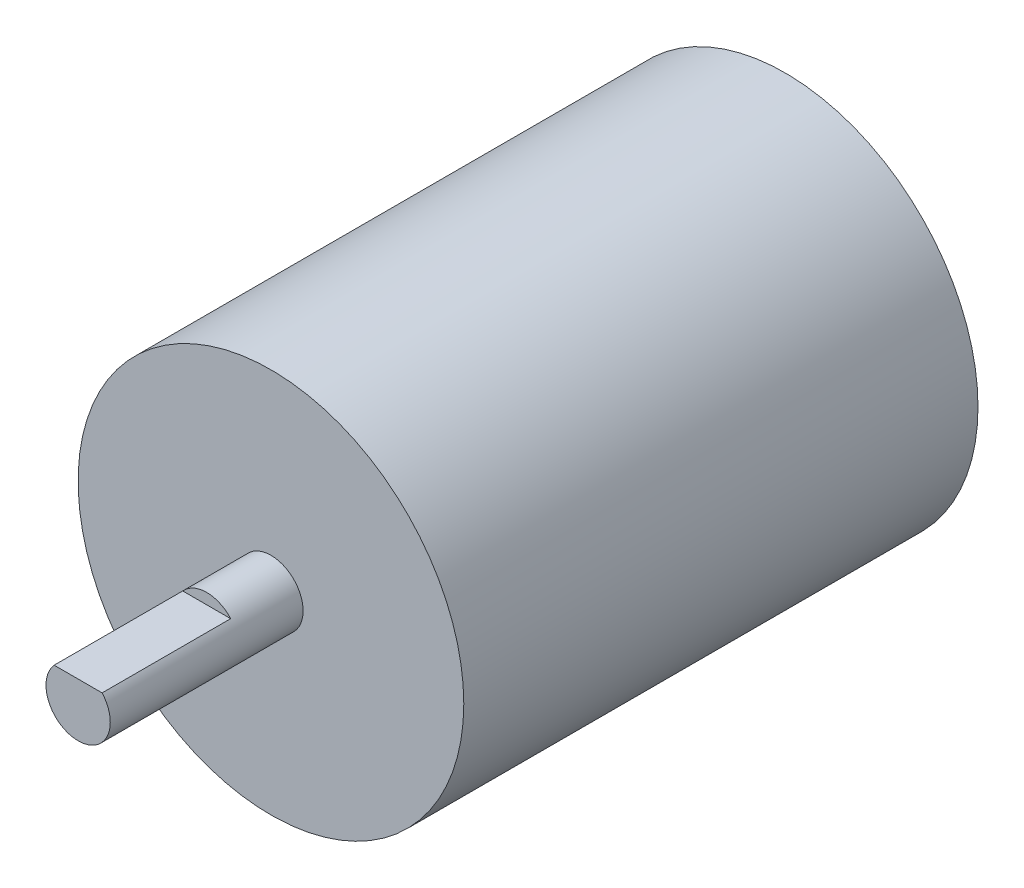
ISO-10303-21;
HEADER;
FILE_DESCRIPTION(('STEP AP214'),'2;1');
FILE_NAME('part.step','',(''),(''),'','','');
FILE_SCHEMA(('AUTOMOTIVE_DESIGN { 1 0 10303 214 1 1 1 1 }'));
ENDSEC;
DATA;
#1=APPLICATION_CONTEXT('core data for automotive mechanical design processes');
#2=APPLICATION_PROTOCOL_DEFINITION('international standard','automotive_design',2000,#1);
#3=PRODUCT_CONTEXT('',#1,'mechanical');
#4=PRODUCT('Part','Part','',(#3));
#5=PRODUCT_RELATED_PRODUCT_CATEGORY('part','',(#4));
#6=PRODUCT_DEFINITION_FORMATION('','',#4);
#7=PRODUCT_DEFINITION_CONTEXT('part definition',#1,'design');
#8=PRODUCT_DEFINITION('design','',#6,#7);
#9=PRODUCT_DEFINITION_SHAPE('','',#8);
#10=(LENGTH_UNIT() NAMED_UNIT(*) SI_UNIT(.MILLI.,.METRE.));
#11=(NAMED_UNIT(*) PLANE_ANGLE_UNIT() SI_UNIT($,.RADIAN.));
#12=(NAMED_UNIT(*) SI_UNIT($,.STERADIAN.) SOLID_ANGLE_UNIT());
#13=UNCERTAINTY_MEASURE_WITH_UNIT(LENGTH_MEASURE(1.E-05),#10,'distance_accuracy_value','');
#14=(GEOMETRIC_REPRESENTATION_CONTEXT(3) GLOBAL_UNCERTAINTY_ASSIGNED_CONTEXT((#13)) GLOBAL_UNIT_ASSIGNED_CONTEXT((#10,
#11,#12)) REPRESENTATION_CONTEXT('',''));
#15=CARTESIAN_POINT('',(0.,0.,0.));
#16=DIRECTION('',(0.,0.,1.));
#17=DIRECTION('',(1.,0.,0.));
#18=AXIS2_PLACEMENT_3D('',#15,#16,#17);
#19=CARTESIAN_POINT('',(0.,0.,50.8));
#20=DIRECTION('',(0.,0.,1.));
#21=DIRECTION('',(1.,0.,0.));
#22=AXIS2_PLACEMENT_3D('',#19,#20,#21);
#23=PLANE('',#22);
#24=CARTESIAN_POINT('',(0.,0.,50.8));
#25=DIRECTION('',(0.,0.,1.));
#26=DIRECTION('',(1.,0.,0.));
#27=AXIS2_PLACEMENT_3D('',#24,#25,#26);
#28=CIRCLE('',#27,19.05);
#29=CARTESIAN_POINT('',(19.05,0.,50.8));
#30=VERTEX_POINT('',#29);
#31=EDGE_CURVE('E62',#30,#30,#28,.T.);
#32=ORIENTED_EDGE('',*,*,#31,.T.);
#33=EDGE_LOOP('',(#32));
#34=FACE_BOUND('',#33,.T.);
#35=CARTESIAN_POINT('',(0.,0.,50.8));
#36=DIRECTION('',(0.,0.,1.));
#37=DIRECTION('',(1.,0.,0.));
#38=AXIS2_PLACEMENT_3D('',#35,#36,#37);
#39=CIRCLE('',#38,3.175);
#40=CARTESIAN_POINT('',(3.175,0.,50.8));
#41=VERTEX_POINT('',#40);
#42=EDGE_CURVE('E72',#41,#41,#39,.T.);
#43=ORIENTED_EDGE('',*,*,#42,.F.);
#44=EDGE_LOOP('',(#43));
#45=FACE_BOUND('',#44,.T.);
#46=ADVANCED_FACE('F33',(#34,#45),#23,.T.);
#47=CARTESIAN_POINT('',(0.,0.,50.8));
#48=DIRECTION('',(0.,0.,-1.));
#49=DIRECTION('',(-1.,0.,0.));
#50=AXIS2_PLACEMENT_3D('',#47,#48,#49);
#51=CYLINDRICAL_SURFACE('',#50,19.05);
#52=ORIENTED_EDGE('',*,*,#31,.F.);
#53=EDGE_LOOP('',(#52));
#54=FACE_BOUND('',#53,.T.);
#55=CARTESIAN_POINT('',(0.,0.,0.));
#56=DIRECTION('',(0.,0.,1.));
#57=DIRECTION('',(1.,0.,0.));
#58=AXIS2_PLACEMENT_3D('',#55,#56,#57);
#59=CIRCLE('',#58,19.05);
#60=CARTESIAN_POINT('',(19.05,0.,0.));
#61=VERTEX_POINT('',#60);
#62=EDGE_CURVE('E71',#61,#61,#59,.T.);
#63=ORIENTED_EDGE('',*,*,#62,.T.);
#64=EDGE_LOOP('',(#63));
#65=FACE_BOUND('',#64,.T.);
#66=ADVANCED_FACE('F35',(#54,#65),#51,.T.);
#67=CARTESIAN_POINT('',(0.,0.,0.));
#68=DIRECTION('',(0.,0.,1.));
#69=DIRECTION('',(1.,0.,0.));
#70=AXIS2_PLACEMENT_3D('',#67,#68,#69);
#71=PLANE('',#70);
#72=ORIENTED_EDGE('',*,*,#62,.F.);
#73=EDGE_LOOP('',(#72));
#74=FACE_BOUND('',#73,.T.);
#75=ADVANCED_FACE('F87',(#74),#71,.F.);
#76=CARTESIAN_POINT('',(0.,0.,69.85));
#77=DIRECTION('',(0.,0.,-1.));
#78=DIRECTION('',(-1.,0.,0.));
#79=AXIS2_PLACEMENT_3D('',#76,#77,#78);
#80=CYLINDRICAL_SURFACE('',#79,3.175);
#81=CARTESIAN_POINT('',(0.,0.,69.85));
#82=DIRECTION('',(0.,0.,1.));
#83=DIRECTION('',(1.,0.,0.));
#84=AXIS2_PLACEMENT_3D('',#81,#82,#83);
#85=CIRCLE('',#84,3.175);
#86=CARTESIAN_POINT('',(-2.37033025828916,2.11238241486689,69.85));
#87=VERTEX_POINT('',#86);
#88=CARTESIAN_POINT('',(2.37033025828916,2.11238241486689,69.85));
#89=VERTEX_POINT('',#88);
#90=EDGE_CURVE('E67',#87,#89,#85,.T.);
#91=ORIENTED_EDGE('',*,*,#90,.F.);
#92=DIRECTION('',(0.,0.,-1.));
#93=VECTOR('',#92,1.);
#94=CARTESIAN_POINT('',(-2.37033025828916,2.11238241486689,69.85));
#95=LINE('',#94,#93);
#96=CARTESIAN_POINT('',(-2.37033025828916,2.11238241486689,57.15));
#97=VERTEX_POINT('',#96);
#98=EDGE_CURVE('E48',#87,#97,#95,.T.);
#99=ORIENTED_EDGE('',*,*,#98,.T.);
#100=CARTESIAN_POINT('',(0.,0.,57.15));
#101=DIRECTION('',(0.,0.,1.));
#102=DIRECTION('',(1.,0.,0.));
#103=AXIS2_PLACEMENT_3D('',#100,#101,#102);
#104=CIRCLE('',#103,3.175);
#105=CARTESIAN_POINT('',(2.37033025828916,2.11238241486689,57.15));
#106=VERTEX_POINT('',#105);
#107=EDGE_CURVE('E11',#106,#97,#104,.T.);
#108=ORIENTED_EDGE('',*,*,#107,.F.);
#109=DIRECTION('',(0.,0.,-1.));
#110=VECTOR('',#109,1.);
#111=CARTESIAN_POINT('',(2.37033025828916,2.11238241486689,69.85));
#112=LINE('',#111,#110);
#113=EDGE_CURVE('E53',#106,#89,#112,.F.);
#114=ORIENTED_EDGE('',*,*,#113,.T.);
#115=EDGE_LOOP('',(#91,#99,#108,#114));
#116=FACE_BOUND('',#115,.T.);
#117=ORIENTED_EDGE('',*,*,#42,.T.);
#118=EDGE_LOOP('',(#117));
#119=FACE_BOUND('',#118,.T.);
#120=ADVANCED_FACE('F65',(#116,#119),#80,.T.);
#121=CARTESIAN_POINT('',(0.,0.,69.85));
#122=DIRECTION('',(0.,0.,1.));
#123=DIRECTION('',(1.,0.,0.));
#124=AXIS2_PLACEMENT_3D('',#121,#122,#123);
#125=PLANE('',#124);
#126=DIRECTION('',(1.,0.,0.));
#127=VECTOR('',#126,1.);
#128=CARTESIAN_POINT('',(0.,2.11238241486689,69.85));
#129=LINE('',#128,#127);
#130=EDGE_CURVE('E41',#87,#89,#129,.T.);
#131=ORIENTED_EDGE('',*,*,#130,.F.);
#132=ORIENTED_EDGE('',*,*,#90,.T.);
#133=EDGE_LOOP('',(#131,#132));
#134=FACE_BOUND('',#133,.T.);
#135=ADVANCED_FACE('F70',(#134),#125,.T.);
#136=CARTESIAN_POINT('',(0.,0.,57.15));
#137=DIRECTION('',(0.,0.,1.));
#138=DIRECTION('',(1.,0.,0.));
#139=AXIS2_PLACEMENT_3D('',#136,#137,#138);
#140=PLANE('',#139);
#141=ORIENTED_EDGE('',*,*,#107,.T.);
#142=DIRECTION('',(1.,0.,0.));
#143=VECTOR('',#142,1.);
#144=CARTESIAN_POINT('',(-3.63177070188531,2.11238241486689,57.15));
#145=LINE('',#144,#143);
#146=EDGE_CURVE('E68',#97,#106,#145,.T.);
#147=ORIENTED_EDGE('',*,*,#146,.T.);
#148=EDGE_LOOP('',(#141,#147));
#149=FACE_BOUND('',#148,.T.);
#150=ADVANCED_FACE('F103',(#149),#140,.T.);
#151=CARTESIAN_POINT('',(-3.63177070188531,2.11238241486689,57.15));
#152=DIRECTION('',(0.,-1.,0.));
#153=DIRECTION('',(0.,0.,-1.));
#154=AXIS2_PLACEMENT_3D('',#151,#152,#153);
#155=PLANE('',#154);
#156=ORIENTED_EDGE('',*,*,#130,.T.);
#157=ORIENTED_EDGE('',*,*,#113,.F.);
#158=ORIENTED_EDGE('',*,*,#146,.F.);
#159=ORIENTED_EDGE('',*,*,#98,.F.);
#160=EDGE_LOOP('',(#156,#157,#158,#159));
#161=FACE_BOUND('',#160,.T.);
#162=ADVANCED_FACE('F58',(#161),#155,.F.);
#163=CLOSED_SHELL('',(#46,#66,#75,#120,#135,#150,#162));
#164=MANIFOLD_SOLID_BREP('B2',#163);
#165=ADVANCED_BREP_SHAPE_REPRESENTATION('',(#18,#164),#14);
#166=SHAPE_DEFINITION_REPRESENTATION(#9,#165);
ENDSEC;
END-ISO-10303-21;
